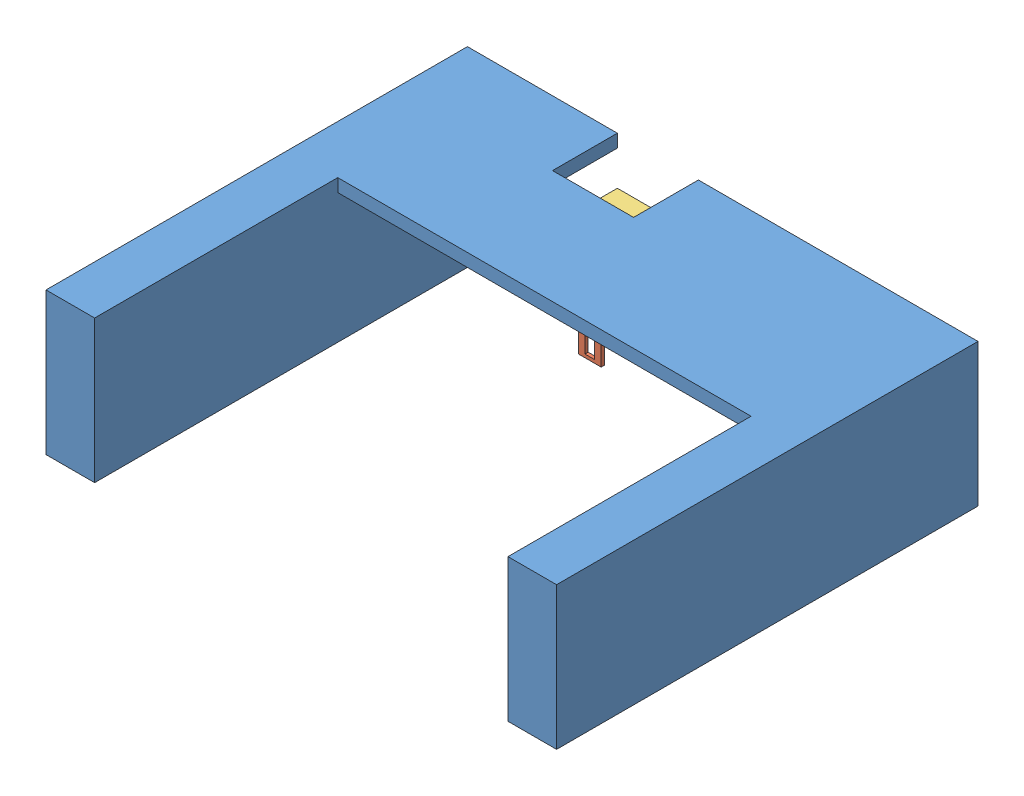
SolidWorks assembly Assemblage_support_Roomba.SLDASM, configuration Défaut (file format 13000). Lengths in mm.
Overall size (340 88 347.23).
3 component instances, 3 part files, 5 mates.
Components (placement in the parent):
- Support_Roomba-1: Support_Roomba.SLDPRT [Défaut] at (-209.5089 -36.7225 -130) size (340 88 347.23)
- Equerre_support_roomba-1: Equerre_support_roomba.SLDPRT [Défaut] at (-99.0089 -36.7225 -90) x (0 1 0) z (1 0 0) size (80 40 14)
- plateau_Support_Roomba-1: plateau_Support_Roomba.SLDPRT [Défaut] at (-122.0089 13.8478 -130) x (1 0 0) z (0 -1 0) size (60 42 16)
Mates (geometry in assembly coordinates):
- Coïncidente1: coincident anti-aligned: plane of Support_Roomba-1 through (-179.5089 43.2775 -130) normal (0 -1 0); plane of Equerre_support_roomba-1 through (-85.0089 43.2775 -90) normal (0 1 0)
- Coïncidente2: coincident aligned: plane of Support_Roomba-1 through (-67.0089 -36.7225 -90) normal (0 0 -1); plane of Equerre_support_roomba-1 through (-85.0089 -36.7225 -90) normal (0 0 -1)
- Distance1: distance = 18 mm: line of Equerre_support_roomba-1 through (-85.0089 -36.7225 -90) axis (0 1 0); plane of Support_Roomba-1 through (-67.0089 -36.7225 -130) normal (-1 0 0)
- Coïncidente4: coincident anti-aligned: plane of Equerre_support_roomba-1 through (-85.0089 -36.7225 -90) normal (0 0 -1); plane of plateau_Support_Roomba-1 through (-122.0089 5.8478 -90) normal (0 0 1)
- Coïncidente5: coincident: plane of Equerre_support_roomba-1 through (-95.0089 43.2775 -56) normal (1 0 0); line of plateau_Support_Roomba-1 through (-95.0089 5.8478 -88) axis (0 1 0)
